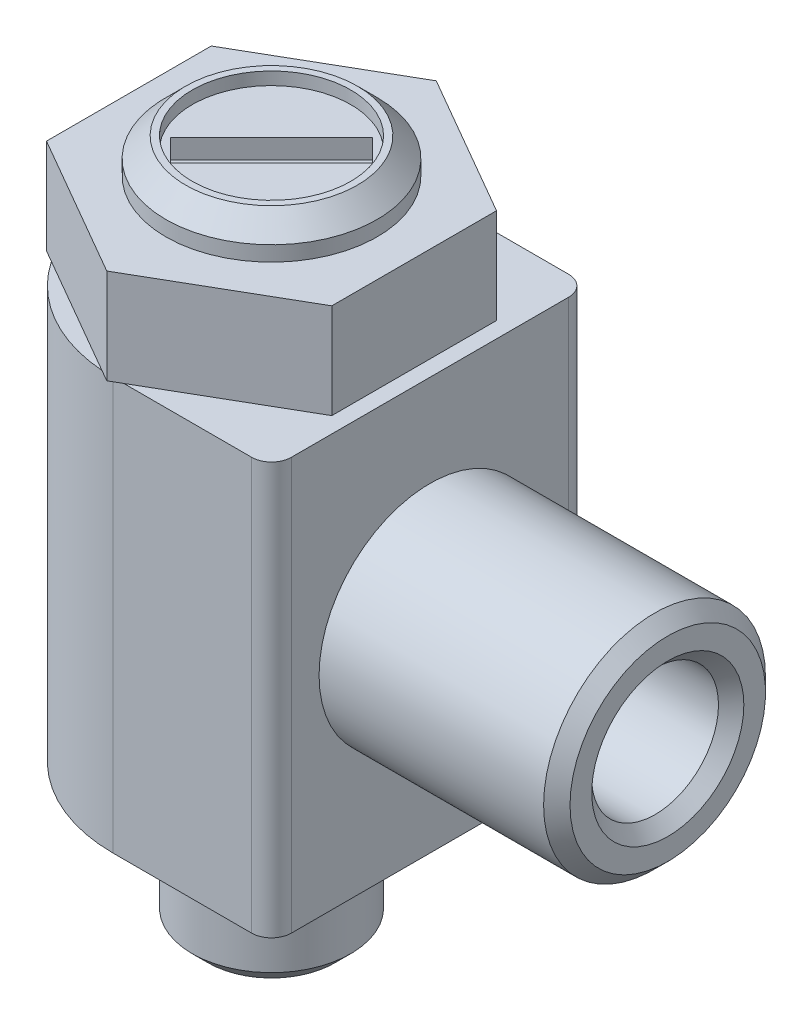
ISO-10303-21;
HEADER;
FILE_DESCRIPTION(('STEP AP214'),'2;1');
FILE_NAME('part.step','',(''),(''),'','','');
FILE_SCHEMA(('AUTOMOTIVE_DESIGN { 1 0 10303 214 1 1 1 1 }'));
ENDSEC;
DATA;
#1=APPLICATION_CONTEXT('core data for automotive mechanical design processes');
#2=APPLICATION_PROTOCOL_DEFINITION('international standard','automotive_design',2000,#1);
#3=PRODUCT_CONTEXT('',#1,'mechanical');
#4=PRODUCT('Part','Part','',(#3));
#5=PRODUCT_RELATED_PRODUCT_CATEGORY('part','',(#4));
#6=PRODUCT_DEFINITION_FORMATION('','',#4);
#7=PRODUCT_DEFINITION_CONTEXT('part definition',#1,'design');
#8=PRODUCT_DEFINITION('design','',#6,#7);
#9=PRODUCT_DEFINITION_SHAPE('','',#8);
#10=(LENGTH_UNIT() NAMED_UNIT(*) SI_UNIT(.MILLI.,.METRE.));
#11=(NAMED_UNIT(*) PLANE_ANGLE_UNIT() SI_UNIT($,.RADIAN.));
#12=(NAMED_UNIT(*) SI_UNIT($,.STERADIAN.) SOLID_ANGLE_UNIT());
#13=UNCERTAINTY_MEASURE_WITH_UNIT(LENGTH_MEASURE(1.E-05),#10,'distance_accuracy_value','');
#14=(GEOMETRIC_REPRESENTATION_CONTEXT(3) GLOBAL_UNCERTAINTY_ASSIGNED_CONTEXT((#13)) GLOBAL_UNIT_ASSIGNED_CONTEXT((#10,
#11,#12)) REPRESENTATION_CONTEXT('',''));
#15=CARTESIAN_POINT('',(0.,0.,0.));
#16=DIRECTION('',(0.,0.,1.));
#17=DIRECTION('',(1.,0.,0.));
#18=AXIS2_PLACEMENT_3D('',#15,#16,#17);
#19=CARTESIAN_POINT('',(0.,16.575,0.));
#20=DIRECTION('',(0.,1.,0.));
#21=DIRECTION('',(0.,0.,1.));
#22=AXIS2_PLACEMENT_3D('',#19,#20,#21);
#23=PLANE('',#22);
#24=DIRECTION('',(-0.707106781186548,0.,0.707106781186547));
#25=VECTOR('',#24,1.);
#26=CARTESIAN_POINT('',(1.23743686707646,16.5750000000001,-1.94454364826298));
#27=LINE('',#26,#25);
#28=CARTESIAN_POINT('',(1.23743686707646,16.5750000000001,-1.94454364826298));
#29=VERTEX_POINT('',#28);
#30=CARTESIAN_POINT('',(-1.94454364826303,16.575,1.23743686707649));
#31=VERTEX_POINT('',#30);
#32=EDGE_CURVE('E610',#29,#31,#27,.T.);
#33=ORIENTED_EDGE('',*,*,#32,.T.);
#34=DIRECTION('',(0.707106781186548,0.,0.707106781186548));
#35=VECTOR('',#34,1.);
#36=CARTESIAN_POINT('',(-1.94454364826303,16.575,1.23743686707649));
#37=LINE('',#36,#35);
#38=CARTESIAN_POINT('',(-1.23743686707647,16.5750000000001,1.94454364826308));
#39=VERTEX_POINT('',#38);
#40=EDGE_CURVE('E615',#31,#39,#37,.T.);
#41=ORIENTED_EDGE('',*,*,#40,.T.);
#42=DIRECTION('',(0.707106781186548,0.,-0.707106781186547));
#43=VECTOR('',#42,1.);
#44=CARTESIAN_POINT('',(-1.23743686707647,16.5750000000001,1.94454364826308));
#45=LINE('',#44,#43);
#46=CARTESIAN_POINT('',(1.94454364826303,16.575,-1.23743686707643));
#47=VERTEX_POINT('',#46);
#48=EDGE_CURVE('E620',#39,#47,#45,.T.);
#49=ORIENTED_EDGE('',*,*,#48,.T.);
#50=DIRECTION('',(-0.707106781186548,0.,-0.707106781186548));
#51=VECTOR('',#50,1.);
#52=CARTESIAN_POINT('',(1.94454364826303,16.575,-1.23743686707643));
#53=LINE('',#52,#51);
#54=EDGE_CURVE('E625',#47,#29,#53,.T.);
#55=ORIENTED_EDGE('',*,*,#54,.T.);
#56=EDGE_LOOP('',(#33,#41,#49,#55));
#57=FACE_BOUND('',#56,.T.);
#58=ADVANCED_FACE('F16',(#57),#23,.T.);
#59=CARTESIAN_POINT('',(-1.23743686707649,17.2000000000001,1.94454364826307));
#60=DIRECTION('',(0.707106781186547,0.,0.707106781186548));
#61=DIRECTION('',(0.707106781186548,0.,-0.707106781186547));
#62=AXIS2_PLACEMENT_3D('',#59,#60,#61);
#63=PLANE('',#62);
#64=DIRECTION('',(0.,1.,0.));
#65=VECTOR('',#64,1.);
#66=CARTESIAN_POINT('',(-1.23743686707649,17.2000000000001,1.94454364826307));
#67=LINE('',#66,#65);
#68=CARTESIAN_POINT('',(-1.23743686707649,17.2000000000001,1.94454364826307));
#69=VERTEX_POINT('',#68);
#70=EDGE_CURVE('E618',#39,#69,#67,.T.);
#71=ORIENTED_EDGE('',*,*,#70,.T.);
#72=DIRECTION('',(-0.707106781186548,0.,0.707106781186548));
#73=VECTOR('',#72,1.);
#74=CARTESIAN_POINT('',(1.94454364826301,17.2,-1.23743686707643));
#75=LINE('',#74,#73);
#76=CARTESIAN_POINT('',(1.94454364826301,17.2,-1.23743686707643));
#77=VERTEX_POINT('',#76);
#78=EDGE_CURVE('E596',#77,#69,#75,.T.);
#79=ORIENTED_EDGE('',*,*,#78,.F.);
#80=DIRECTION('',(0.,1.,0.));
#81=VECTOR('',#80,1.);
#82=CARTESIAN_POINT('',(1.94454364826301,17.2,-1.23743686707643));
#83=LINE('',#82,#81);
#84=EDGE_CURVE('E600',#77,#47,#83,.F.);
#85=ORIENTED_EDGE('',*,*,#84,.T.);
#86=ORIENTED_EDGE('',*,*,#48,.F.);
#87=EDGE_LOOP('',(#71,#79,#85,#86));
#88=FACE_BOUND('',#87,.T.);
#89=ADVANCED_FACE('F647',(#88),#63,.F.);
#90=CARTESIAN_POINT('',(-1.94454364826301,17.2,1.23743686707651));
#91=DIRECTION('',(-0.707106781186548,0.,0.707106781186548));
#92=DIRECTION('',(0.707106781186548,0.,0.707106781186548));
#93=AXIS2_PLACEMENT_3D('',#90,#91,#92);
#94=PLANE('',#93);
#95=DIRECTION('',(0.,1.,0.));
#96=VECTOR('',#95,1.);
#97=CARTESIAN_POINT('',(-1.94454364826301,17.2,1.23743686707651));
#98=LINE('',#97,#96);
#99=CARTESIAN_POINT('',(-1.94454364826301,17.2,1.23743686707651));
#100=VERTEX_POINT('',#99);
#101=EDGE_CURVE('E613',#31,#100,#98,.T.);
#102=ORIENTED_EDGE('',*,*,#101,.T.);
#103=DIRECTION('',(-0.707106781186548,0.,-0.707106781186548));
#104=VECTOR('',#103,1.);
#105=CARTESIAN_POINT('',(-1.23743686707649,17.2000000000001,1.94454364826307));
#106=LINE('',#105,#104);
#107=EDGE_CURVE('E599',#69,#100,#106,.T.);
#108=ORIENTED_EDGE('',*,*,#107,.F.);
#109=ORIENTED_EDGE('',*,*,#70,.F.);
#110=ORIENTED_EDGE('',*,*,#40,.F.);
#111=EDGE_LOOP('',(#102,#108,#109,#110));
#112=FACE_BOUND('',#111,.T.);
#113=ADVANCED_FACE('F641',(#112),#94,.F.);
#114=CARTESIAN_POINT('',(1.23743686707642,17.2000000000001,-1.94454364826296));
#115=DIRECTION('',(-0.707106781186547,0.,-0.707106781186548));
#116=DIRECTION('',(-0.707106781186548,0.,0.707106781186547));
#117=AXIS2_PLACEMENT_3D('',#114,#115,#116);
#118=PLANE('',#117);
#119=DIRECTION('',(0.,1.,0.));
#120=VECTOR('',#119,1.);
#121=CARTESIAN_POINT('',(1.23743686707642,17.2000000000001,-1.94454364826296));
#122=LINE('',#121,#120);
#123=CARTESIAN_POINT('',(1.23743686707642,17.2000000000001,-1.94454364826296));
#124=VERTEX_POINT('',#123);
#125=EDGE_CURVE('E121',#29,#124,#122,.T.);
#126=ORIENTED_EDGE('',*,*,#125,.T.);
#127=DIRECTION('',(0.707106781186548,0.,-0.707106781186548));
#128=VECTOR('',#127,1.);
#129=CARTESIAN_POINT('',(-1.94454364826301,17.2,1.23743686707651));
#130=LINE('',#129,#128);
#131=EDGE_CURVE('E603',#100,#124,#130,.T.);
#132=ORIENTED_EDGE('',*,*,#131,.F.);
#133=ORIENTED_EDGE('',*,*,#101,.F.);
#134=ORIENTED_EDGE('',*,*,#32,.F.);
#135=EDGE_LOOP('',(#126,#132,#133,#134));
#136=FACE_BOUND('',#135,.T.);
#137=ADVANCED_FACE('F634',(#136),#118,.F.);
#138=CARTESIAN_POINT('',(1.94454364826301,17.2,-1.23743686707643));
#139=DIRECTION('',(0.707106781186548,0.,-0.707106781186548));
#140=DIRECTION('',(-0.707106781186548,0.,-0.707106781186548));
#141=AXIS2_PLACEMENT_3D('',#138,#139,#140);
#142=PLANE('',#141);
#143=ORIENTED_EDGE('',*,*,#84,.F.);
#144=DIRECTION('',(0.707106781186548,0.,0.707106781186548));
#145=VECTOR('',#144,1.);
#146=CARTESIAN_POINT('',(1.23743686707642,17.2000000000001,-1.94454364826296));
#147=LINE('',#146,#145);
#148=EDGE_CURVE('E606',#124,#77,#147,.T.);
#149=ORIENTED_EDGE('',*,*,#148,.F.);
#150=ORIENTED_EDGE('',*,*,#125,.F.);
#151=ORIENTED_EDGE('',*,*,#54,.F.);
#152=EDGE_LOOP('',(#143,#149,#150,#151));
#153=FACE_BOUND('',#152,.T.);
#154=ADVANCED_FACE('F635',(#153),#142,.F.);
#155=CARTESIAN_POINT('',(1.24999999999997,17.2,0.));
#156=DIRECTION('',(0.,1.,0.));
#157=DIRECTION('',(0.,0.,1.));
#158=AXIS2_PLACEMENT_3D('',#155,#156,#157);
#159=PLANE('',#158);
#160=CARTESIAN_POINT('',(0.,17.2,0.));
#161=DIRECTION('',(0.,1.,0.));
#162=DIRECTION('',(0.,0.,1.));
#163=AXIS2_PLACEMENT_3D('',#160,#161,#162);
#164=CIRCLE('',#163,2.5);
#165=CARTESIAN_POINT('',(0.,17.2,2.50000000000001));
#166=VERTEX_POINT('',#165);
#167=EDGE_CURVE('E20',#166,#166,#164,.T.);
#168=ORIENTED_EDGE('',*,*,#167,.T.);
#169=EDGE_LOOP('',(#168));
#170=FACE_BOUND('',#169,.T.);
#171=ORIENTED_EDGE('',*,*,#131,.T.);
#172=ORIENTED_EDGE('',*,*,#148,.T.);
#173=ORIENTED_EDGE('',*,*,#78,.T.);
#174=ORIENTED_EDGE('',*,*,#107,.T.);
#175=EDGE_LOOP('',(#171,#172,#173,#174));
#176=FACE_BOUND('',#175,.T.);
#177=ADVANCED_FACE('F637',(#170,#176),#159,.T.);
#178=CARTESIAN_POINT('',(0.,8.1,0.));
#179=DIRECTION('',(-1.,0.,0.));
#180=DIRECTION('',(0.,0.,1.));
#181=AXIS2_PLACEMENT_3D('',#178,#179,#180);
#182=PLANE('',#181);
#183=CARTESIAN_POINT('',(0.,7.1,0.));
#184=DIRECTION('',(-1.,0.,0.));
#185=DIRECTION('',(0.,0.,1.));
#186=AXIS2_PLACEMENT_3D('',#183,#184,#185);
#187=CIRCLE('',#186,2.);
#188=CARTESIAN_POINT('',(0.,8.6612494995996,1.25000000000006));
#189=VERTEX_POINT('',#188);
#190=CARTESIAN_POINT('',(0.,5.5387505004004,1.25000000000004));
#191=VERTEX_POINT('',#190);
#192=EDGE_CURVE('E686',#189,#191,#187,.F.);
#193=ORIENTED_EDGE('',*,*,#192,.T.);
#194=DIRECTION('',(0.,1.,0.));
#195=VECTOR('',#194,1.);
#196=CARTESIAN_POINT('',(0.,4.9,1.25000000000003));
#197=LINE('',#196,#195);
#198=EDGE_CURVE('E593',#191,#189,#197,.T.);
#199=ORIENTED_EDGE('',*,*,#198,.T.);
#200=EDGE_LOOP('',(#193,#199));
#201=FACE_BOUND('',#200,.T.);
#202=ADVANCED_FACE('F663',(#201),#182,.F.);
#203=CARTESIAN_POINT('',(0.,8.1,0.));
#204=DIRECTION('',(-1.,0.,0.));
#205=DIRECTION('',(0.,0.,1.));
#206=AXIS2_PLACEMENT_3D('',#203,#204,#205);
#207=PLANE('',#206);
#208=CARTESIAN_POINT('',(0.,7.1,0.));
#209=DIRECTION('',(-1.,0.,0.));
#210=DIRECTION('',(0.,0.,1.));
#211=AXIS2_PLACEMENT_3D('',#208,#209,#210);
#212=CIRCLE('',#211,2.);
#213=CARTESIAN_POINT('',(0.,5.5387505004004,-1.24999999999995));
#214=VERTEX_POINT('',#213);
#215=CARTESIAN_POINT('',(0.,8.6612494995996,-1.24999999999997));
#216=VERTEX_POINT('',#215);
#217=EDGE_CURVE('E595',#214,#216,#212,.F.);
#218=ORIENTED_EDGE('',*,*,#217,.T.);
#219=DIRECTION('',(0.,1.,0.));
#220=VECTOR('',#219,1.);
#221=CARTESIAN_POINT('',(0.,4.9,-1.24999999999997));
#222=LINE('',#221,#220);
#223=EDGE_CURVE('E328',#216,#214,#222,.F.);
#224=ORIENTED_EDGE('',*,*,#223,.T.);
#225=EDGE_LOOP('',(#218,#224));
#226=FACE_BOUND('',#225,.T.);
#227=ADVANCED_FACE('F667',(#226),#207,.F.);
#228=CARTESIAN_POINT('',(0.624999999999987,13.9,0.));
#229=DIRECTION('',(0.,1.,0.));
#230=DIRECTION('',(0.,0.,1.));
#231=AXIS2_PLACEMENT_3D('',#228,#229,#230);
#232=PLANE('',#231);
#233=CARTESIAN_POINT('',(0.,13.9,0.));
#234=DIRECTION('',(0.,1.,0.));
#235=DIRECTION('',(0.,0.,1.));
#236=AXIS2_PLACEMENT_3D('',#233,#234,#235);
#237=CIRCLE('',#236,1.25);
#238=CARTESIAN_POINT('',(0.,13.9,1.25000000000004));
#239=VERTEX_POINT('',#238);
#240=EDGE_CURVE('E319',#239,#239,#237,.F.);
#241=ORIENTED_EDGE('',*,*,#240,.T.);
#242=EDGE_LOOP('',(#241));
#243=FACE_BOUND('',#242,.T.);
#244=ADVANCED_FACE('F671',(#243),#232,.F.);
#245=CARTESIAN_POINT('',(0.,17.4,0.));
#246=DIRECTION('',(0.,1.,0.));
#247=DIRECTION('',(0.,0.,1.));
#248=AXIS2_PLACEMENT_3D('',#245,#246,#247);
#249=CYLINDRICAL_SURFACE('',#248,2.5);
#250=ORIENTED_EDGE('',*,*,#167,.F.);
#251=EDGE_LOOP('',(#250));
#252=FACE_BOUND('',#251,.T.);
#253=CARTESIAN_POINT('',(0.,17.6,0.));
#254=DIRECTION('',(0.,1.,0.));
#255=DIRECTION('',(0.,0.,1.));
#256=AXIS2_PLACEMENT_3D('',#253,#254,#255);
#257=CIRCLE('',#256,2.5);
#258=CARTESIAN_POINT('',(0.,17.6,2.50000000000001));
#259=VERTEX_POINT('',#258);
#260=EDGE_CURVE('E248',#259,#259,#257,.F.);
#261=ORIENTED_EDGE('',*,*,#260,.F.);
#262=EDGE_LOOP('',(#261));
#263=FACE_BOUND('',#262,.T.);
#264=ADVANCED_FACE('F674',(#252,#263),#249,.F.);
#265=CARTESIAN_POINT('',(6.05,7.10000000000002,0.));
#266=DIRECTION('',(-1.,0.,0.));
#267=DIRECTION('',(0.,0.,1.));
#268=AXIS2_PLACEMENT_3D('',#265,#266,#267);
#269=CYLINDRICAL_SURFACE('',#268,2.);
#270=CARTESIAN_POINT('',(0.,5.5387505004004,-1.24999999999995));
#271=CARTESIAN_POINT('',(0.0313026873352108,5.53876117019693,-1.2500041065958));
#272=CARTESIAN_POINT('',(0.0625845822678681,5.53780799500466,-1.24882344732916));
#273=CARTESIAN_POINT('',(0.124830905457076,5.5340736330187,-1.24414174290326));
#274=CARTESIAN_POINT('',(0.155795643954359,5.53129444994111,-1.24064324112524));
#275=CARTESIAN_POINT('',(0.247320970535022,5.52043301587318,-1.22682862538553));
#276=CARTESIAN_POINT('',(0.307115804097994,5.50982303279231,-1.21319125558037));
#277=CARTESIAN_POINT('',(0.422726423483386,5.4835167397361,-1.17790269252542));
#278=CARTESIAN_POINT('',(0.47855698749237,5.46784067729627,-1.15628335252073));
#279=CARTESIAN_POINT('',(0.585877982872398,5.43321679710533,-1.10579052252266));
#280=CARTESIAN_POINT('',(0.63735726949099,5.41426093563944,-1.07689911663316));
#281=CARTESIAN_POINT('',(0.741878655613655,5.3721991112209,-1.00823145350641));
#282=CARTESIAN_POINT('',(0.794217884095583,5.34887650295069,-0.967518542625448));
#283=CARTESIAN_POINT('',(0.89190206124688,5.30246171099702,-0.878287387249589));
#284=CARTESIAN_POINT('',(0.937243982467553,5.27936963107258,-0.829765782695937));
#285=CARTESIAN_POINT('',(1.02511066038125,5.23270174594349,-0.719178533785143));
#286=CARTESIAN_POINT('',(1.06662993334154,5.20940578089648,-0.656184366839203));
#287=CARTESIAN_POINT('',(1.13813483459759,5.16816205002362,-0.522379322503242));
#288=CARTESIAN_POINT('',(1.16813536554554,5.15020738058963,-0.451578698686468));
#289=CARTESIAN_POINT('',(1.21064440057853,5.12441614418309,-0.317576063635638));
#290=CARTESIAN_POINT('',(1.2253304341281,5.11533951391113,-0.25530287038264));
#291=CARTESIAN_POINT('',(1.24500431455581,5.1031339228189,-0.128684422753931));
#292=CARTESIAN_POINT('',(1.24999928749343,5.1000005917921,-0.064340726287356));
#293=CARTESIAN_POINT('',(1.25000070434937,5.09999941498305,0.0636041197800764));
#294=CARTESIAN_POINT('',(1.24512084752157,5.10306024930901,0.127205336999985));
#295=CARTESIAN_POINT('',(1.22589107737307,5.11499299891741,0.252399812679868));
#296=CARTESIAN_POINT('',(1.21153746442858,5.1238671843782,0.313992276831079));
#297=CARTESIAN_POINT('',(1.17419114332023,5.14653983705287,0.433201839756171));
#298=CARTESIAN_POINT('',(1.1512355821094,5.1603171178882,0.490834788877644));
#299=CARTESIAN_POINT('',(1.09762115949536,5.19165005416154,0.601247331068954));
#300=CARTESIAN_POINT('',(1.06696137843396,5.20920616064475,0.654026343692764));
#301=CARTESIAN_POINT('',(0.99611922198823,5.24829518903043,0.757965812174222));
#302=CARTESIAN_POINT('',(0.95537328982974,5.27003338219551,0.808663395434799));
#303=CARTESIAN_POINT('',(0.866796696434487,5.31467915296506,0.90297224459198));
#304=CARTESIAN_POINT('',(0.818954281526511,5.33758862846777,0.946571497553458));
#305=CARTESIAN_POINT('',(0.709906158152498,5.38572132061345,1.03147397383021));
#306=CARTESIAN_POINT('',(0.64776780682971,5.41083395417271,1.07165304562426));
#307=CARTESIAN_POINT('',(0.516304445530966,5.45673989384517,1.14079716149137));
#308=CARTESIAN_POINT('',(0.447006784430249,5.47754878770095,1.16980301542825));
#309=CARTESIAN_POINT('',(0.315424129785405,5.50824338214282,1.21113990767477));
#310=CARTESIAN_POINT('',(0.254105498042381,5.51941784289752,1.22552680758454));
#311=CARTESIAN_POINT('',(0.160139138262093,5.53087292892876,1.24011165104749));
#312=CARTESIAN_POINT('',(0.128325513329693,5.53380797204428,1.24380797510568));
#313=CARTESIAN_POINT('',(0.0643486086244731,5.53775419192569,1.24875630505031));
#314=CARTESIAN_POINT('',(0.0321849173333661,5.5387627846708,1.25000502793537));
#315=CARTESIAN_POINT('',(0.,5.5387505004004,1.25000000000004));
#316=B_SPLINE_CURVE_WITH_KNOTS('',3,(#270,#271,#272,#273,#274,#275,#276,#277,#278,#279,#280,
#281,#282,#283,#284,#285,#286,#287,#288,#289,#290,#291,#292,#293,#294,#295,#296,#297,#298,#299,
#300,#301,#302,#303,#304,#305,#306,#307,#308,#309,#310,#311,#312,#313,#314,#315),.UNSPECIFIED.,
.F.,.F.,(4,2,2,2,2,2,2,2,2,2,2,2,2,2,2,2,2,2,2,2,2,2,4),(0.,0.0938329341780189,
0.187563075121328,0.3732425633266,0.558188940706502,0.743595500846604,0.953662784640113,
1.16382070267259,1.39941924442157,1.63471193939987,1.82761740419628,2.02038096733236,
2.21093767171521,2.40156883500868,2.59138608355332,2.78122600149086,2.98616996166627,
3.19145723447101,3.42474295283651,3.65716833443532,3.84797308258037,3.94431993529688,
4.04079593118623),.UNSPECIFIED.);
#317=EDGE_CURVE('E112',#214,#191,#316,.T.);
#318=ORIENTED_EDGE('',*,*,#317,.T.);
#319=ORIENTED_EDGE('',*,*,#192,.F.);
#320=CARTESIAN_POINT('',(0.,8.6612494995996,1.25000000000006));
#321=CARTESIAN_POINT('',(0.0313026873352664,8.66123882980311,1.25000410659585));
#322=CARTESIAN_POINT('',(0.062584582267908,8.6621920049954,1.24882344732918));
#323=CARTESIAN_POINT('',(0.124830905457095,8.66592636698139,1.24414174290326));
#324=CARTESIAN_POINT('',(0.155795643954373,8.66870555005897,1.24064324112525));
#325=CARTESIAN_POINT('',(0.247320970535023,8.67956698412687,1.22682862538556));
#326=CARTESIAN_POINT('',(0.307115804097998,8.69017696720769,1.21319125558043));
#327=CARTESIAN_POINT('',(0.422726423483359,8.71648326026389,1.17790269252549));
#328=CARTESIAN_POINT('',(0.478556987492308,8.73215932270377,1.15628335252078));
#329=CARTESIAN_POINT('',(0.585877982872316,8.76678320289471,1.10579052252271));
#330=CARTESIAN_POINT('',(0.637357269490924,8.78573906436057,1.07689911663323));
#331=CARTESIAN_POINT('',(0.741878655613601,8.82780088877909,1.0082314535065));
#332=CARTESIAN_POINT('',(0.794217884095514,8.85112349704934,0.967518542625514));
#333=CARTESIAN_POINT('',(0.891902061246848,8.89753828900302,0.878287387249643));
#334=CARTESIAN_POINT('',(0.937243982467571,8.92063036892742,0.829765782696));
#335=CARTESIAN_POINT('',(1.02511066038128,8.9672982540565,0.719178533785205));
#336=CARTESIAN_POINT('',(1.06662993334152,8.99059421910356,0.656184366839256));
#337=CARTESIAN_POINT('',(1.13813483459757,9.03183794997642,0.522379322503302));
#338=CARTESIAN_POINT('',(1.16813536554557,9.04979261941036,0.451578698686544));
#339=CARTESIAN_POINT('',(1.21064440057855,9.0755838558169,0.317576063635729));
#340=CARTESIAN_POINT('',(1.22533043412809,9.0846604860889,0.255302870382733));
#341=CARTESIAN_POINT('',(1.24500431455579,9.09686607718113,0.128684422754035));
#342=CARTESIAN_POINT('',(1.24999928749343,9.0999994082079,0.0643407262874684));
#343=CARTESIAN_POINT('',(1.25000070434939,9.10000058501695,-0.0636041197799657));
#344=CARTESIAN_POINT('',(1.24512084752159,9.09693975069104,-0.127205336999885));
#345=CARTESIAN_POINT('',(1.22589107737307,9.08500700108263,-0.252399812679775));
#346=CARTESIAN_POINT('',(1.21153746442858,9.07613281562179,-0.313992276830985));
#347=CARTESIAN_POINT('',(1.17419114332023,9.05346016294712,-0.43320183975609));
#348=CARTESIAN_POINT('',(1.15123558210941,9.03968288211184,-0.490834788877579));
#349=CARTESIAN_POINT('',(1.09762115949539,9.00834994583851,-0.601247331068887));
#350=CARTESIAN_POINT('',(1.06696137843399,8.99079383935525,-0.654026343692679));
#351=CARTESIAN_POINT('',(0.996119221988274,8.95170481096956,-0.757965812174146));
#352=CARTESIAN_POINT('',(0.95537328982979,8.92996661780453,-0.808663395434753));
#353=CARTESIAN_POINT('',(0.866796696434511,8.88532084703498,-0.902972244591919));
#354=CARTESIAN_POINT('',(0.818954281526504,8.86241137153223,-0.94657149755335));
#355=CARTESIAN_POINT('',(0.70990615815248,8.81427867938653,-1.03147397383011));
#356=CARTESIAN_POINT('',(0.647767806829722,8.78916604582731,-1.07165304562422));
#357=CARTESIAN_POINT('',(0.516304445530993,8.74326010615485,-1.14079716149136));
#358=CARTESIAN_POINT('',(0.447006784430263,8.72245121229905,-1.16980301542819));
#359=CARTESIAN_POINT('',(0.315424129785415,8.69175661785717,-1.21113990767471));
#360=CARTESIAN_POINT('',(0.254105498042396,8.68058215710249,-1.22552680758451));
#361=CARTESIAN_POINT('',(0.160139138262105,8.66912707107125,-1.24011165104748));
#362=CARTESIAN_POINT('',(0.128325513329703,8.66619202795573,-1.24380797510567));
#363=CARTESIAN_POINT('',(0.0643486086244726,8.66224580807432,-1.24875630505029));
#364=CARTESIAN_POINT('',(0.0321849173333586,8.6612372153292,-1.25000502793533));
#365=CARTESIAN_POINT('',(0.,8.6612494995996,-1.24999999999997));
#366=B_SPLINE_CURVE_WITH_KNOTS('',3,(#320,#321,#322,#323,#324,#325,#326,#327,#328,#329,#330,
#331,#332,#333,#334,#335,#336,#337,#338,#339,#340,#341,#342,#343,#344,#345,#346,#347,#348,#349,
#350,#351,#352,#353,#354,#355,#356,#357,#358,#359,#360,#361,#362,#363,#364,#365),.UNSPECIFIED.,
.F.,.F.,(4,2,2,2,2,2,2,2,2,2,2,2,2,2,2,2,2,2,2,2,2,2,4),(0.,0.0938329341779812,
0.187563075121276,0.373242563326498,0.558188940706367,0.74359550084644,0.953662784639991,
1.16382070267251,1.39941924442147,1.63471193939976,1.82761740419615,2.02038096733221,
2.21093767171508,2.40156883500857,2.59138608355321,2.78122600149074,2.98616996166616,
3.19145723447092,3.42474295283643,3.65716833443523,3.84797308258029,3.94431993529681,
4.04079593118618),.UNSPECIFIED.);
#367=EDGE_CURVE('E104',#189,#216,#366,.T.);
#368=ORIENTED_EDGE('',*,*,#367,.T.);
#369=ORIENTED_EDGE('',*,*,#217,.F.);
#370=EDGE_LOOP('',(#318,#319,#368,#369));
#371=FACE_BOUND('',#370,.T.);
#372=CARTESIAN_POINT('',(12.1000000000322,7.10000000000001,0.));
#373=DIRECTION('',(1.,0.,0.));
#374=DIRECTION('',(0.,1.,0.));
#375=AXIS2_PLACEMENT_3D('',#372,#373,#374);
#376=CIRCLE('',#375,2.00000000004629);
#377=CARTESIAN_POINT('',(12.1000000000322,9.10000000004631,0.));
#378=VERTEX_POINT('',#377);
#379=EDGE_CURVE('E244',#378,#378,#376,.T.);
#380=ORIENTED_EDGE('',*,*,#379,.T.);
#381=EDGE_LOOP('',(#380));
#382=FACE_BOUND('',#381,.T.);
#383=ADVANCED_FACE('F333',(#371,#382),#269,.F.);
#384=CARTESIAN_POINT('',(0.,4.9,0.));
#385=DIRECTION('',(0.,1.,0.));
#386=DIRECTION('',(0.,0.,1.));
#387=AXIS2_PLACEMENT_3D('',#384,#385,#386);
#388=CYLINDRICAL_SURFACE('',#387,1.25);
#389=CARTESIAN_POINT('',(0.,-4.,0.));
#390=DIRECTION('',(0.,1.,0.));
#391=DIRECTION('',(0.,0.,1.));
#392=AXIS2_PLACEMENT_3D('',#389,#390,#391);
#393=CIRCLE('',#392,1.25);
#394=CARTESIAN_POINT('',(0.,-4.,1.25000000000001));
#395=VERTEX_POINT('',#394);
#396=EDGE_CURVE('E247',#395,#395,#393,.T.);
#397=ORIENTED_EDGE('',*,*,#396,.F.);
#398=EDGE_LOOP('',(#397));
#399=FACE_BOUND('',#398,.T.);
#400=ORIENTED_EDGE('',*,*,#240,.F.);
#401=EDGE_LOOP('',(#400));
#402=FACE_BOUND('',#401,.T.);
#403=ORIENTED_EDGE('',*,*,#198,.F.);
#404=ORIENTED_EDGE('',*,*,#317,.F.);
#405=ORIENTED_EDGE('',*,*,#223,.F.);
#406=ORIENTED_EDGE('',*,*,#367,.F.);
#407=EDGE_LOOP('',(#403,#404,#405,#406));
#408=FACE_BOUND('',#407,.T.);
#409=ADVANCED_FACE('F336',(#399,#402,#408),#388,.F.);
#410=CARTESIAN_POINT('',(2.60416666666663,17.6,0.));
#411=DIRECTION('',(0.,1.,0.));
#412=DIRECTION('',(0.,0.,1.));
#413=AXIS2_PLACEMENT_3D('',#410,#411,#412);
#414=PLANE('',#413);
#415=CARTESIAN_POINT('',(0.,17.6000000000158,0.));
#416=DIRECTION('',(0.,-1.,0.));
#417=DIRECTION('',(0.,0.,-1.));
#418=AXIS2_PLACEMENT_3D('',#415,#416,#417);
#419=CIRCLE('',#418,2.70833333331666);
#420=CARTESIAN_POINT('',(0.,17.6000000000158,-2.70833333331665));
#421=VERTEX_POINT('',#420);
#422=EDGE_CURVE('E312',#421,#421,#419,.T.);
#423=ORIENTED_EDGE('',*,*,#422,.F.);
#424=EDGE_LOOP('',(#423));
#425=FACE_BOUND('',#424,.T.);
#426=ORIENTED_EDGE('',*,*,#260,.T.);
#427=EDGE_LOOP('',(#426));
#428=FACE_BOUND('',#427,.T.);
#429=ADVANCED_FACE('F340',(#425,#428),#414,.T.);
#430=CARTESIAN_POINT('',(12.4999999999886,7.10000000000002,0.));
#431=DIRECTION('',(1.,0.,0.));
#432=DIRECTION('',(0.,0.,-1.));
#433=AXIS2_PLACEMENT_3D('',#430,#431,#432);
#434=CONICAL_SURFACE('',#433,2.40000000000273,0.785398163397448);
#435=ORIENTED_EDGE('',*,*,#379,.F.);
#436=EDGE_LOOP('',(#435));
#437=FACE_BOUND('',#436,.T.);
#438=CARTESIAN_POINT('',(12.4999999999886,7.10000000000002,0.));
#439=DIRECTION('',(1.,0.,0.));
#440=DIRECTION('',(0.,0.,-1.));
#441=AXIS2_PLACEMENT_3D('',#438,#439,#440);
#442=CIRCLE('',#441,2.40000000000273);
#443=CARTESIAN_POINT('',(12.4999999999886,7.10000000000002,-2.4000000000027));
#444=VERTEX_POINT('',#443);
#445=EDGE_CURVE('E309',#444,#444,#442,.F.);
#446=ORIENTED_EDGE('',*,*,#445,.F.);
#447=EDGE_LOOP('',(#446));
#448=FACE_BOUND('',#447,.T.);
#449=ADVANCED_FACE('F345',(#437,#448),#434,.F.);
#450=CARTESIAN_POINT('',(1.,-4.,0.));
#451=DIRECTION('',(0.,-1.,0.));
#452=DIRECTION('',(0.,0.,-1.));
#453=AXIS2_PLACEMENT_3D('',#450,#451,#452);
#454=PLANE('',#453);
#455=CARTESIAN_POINT('',(0.,-3.99999999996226,0.));
#456=DIRECTION('',(0.,1.,0.));
#457=DIRECTION('',(0.,0.,1.));
#458=AXIS2_PLACEMENT_3D('',#455,#456,#457);
#459=CIRCLE('',#458,2.00000000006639);
#460=CARTESIAN_POINT('',(0.,-3.99999999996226,2.00000000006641));
#461=VERTEX_POINT('',#460);
#462=EDGE_CURVE('E243',#461,#461,#459,.T.);
#463=ORIENTED_EDGE('',*,*,#462,.F.);
#464=EDGE_LOOP('',(#463));
#465=FACE_BOUND('',#464,.T.);
#466=ORIENTED_EDGE('',*,*,#396,.T.);
#467=EDGE_LOOP('',(#466));
#468=FACE_BOUND('',#467,.T.);
#469=ADVANCED_FACE('F349',(#465,#468),#454,.T.);
#470=CARTESIAN_POINT('',(0.,16.9750000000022,0.));
#471=DIRECTION('',(0.,-1.,0.));
#472=DIRECTION('',(0.,0.,-1.));
#473=AXIS2_PLACEMENT_3D('',#470,#471,#472);
#474=CONICAL_SURFACE('',#473,3.3333333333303,0.785398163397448);
#475=ORIENTED_EDGE('',*,*,#422,.T.);
#476=EDGE_LOOP('',(#475));
#477=FACE_BOUND('',#476,.T.);
#478=CARTESIAN_POINT('',(0.,16.975,0.));
#479=DIRECTION('',(0.,1.,0.));
#480=DIRECTION('',(0.,0.,1.));
#481=AXIS2_PLACEMENT_3D('',#478,#479,#480);
#482=CIRCLE('',#481,3.33333333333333);
#483=CARTESIAN_POINT('',(0.,16.975,3.33333333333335));
#484=VERTEX_POINT('',#483);
#485=EDGE_CURVE('E240',#484,#484,#482,.F.);
#486=ORIENTED_EDGE('',*,*,#485,.F.);
#487=EDGE_LOOP('',(#486));
#488=FACE_BOUND('',#487,.T.);
#489=ADVANCED_FACE('F353',(#477,#488),#474,.T.);
#490=CARTESIAN_POINT('',(12.5,8.64166666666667,0.));
#491=DIRECTION('',(1.,0.,0.));
#492=DIRECTION('',(0.,0.,-1.));
#493=AXIS2_PLACEMENT_3D('',#490,#491,#492);
#494=PLANE('',#493);
#495=CARTESIAN_POINT('',(12.5000000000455,7.10000000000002,0.));
#496=DIRECTION('',(-1.,0.,0.));
#497=DIRECTION('',(0.,0.,1.));
#498=AXIS2_PLACEMENT_3D('',#495,#496,#497);
#499=CIRCLE('',#498,3.08333333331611);
#500=CARTESIAN_POINT('',(12.5000000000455,7.10000000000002,3.08333333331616));
#501=VERTEX_POINT('',#500);
#502=EDGE_CURVE('E239',#501,#501,#499,.T.);
#503=ORIENTED_EDGE('',*,*,#502,.F.);
#504=EDGE_LOOP('',(#503));
#505=FACE_BOUND('',#504,.T.);
#506=ORIENTED_EDGE('',*,*,#445,.T.);
#507=EDGE_LOOP('',(#506));
#508=FACE_BOUND('',#507,.T.);
#509=ADVANCED_FACE('F357',(#505,#508),#494,.T.);
#510=CARTESIAN_POINT('',(0.,-3.49999999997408,0.));
#511=DIRECTION('',(0.,1.,0.));
#512=DIRECTION('',(0.,0.,1.));
#513=AXIS2_PLACEMENT_3D('',#510,#511,#512);
#514=CONICAL_SURFACE('',#513,2.50000000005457,0.785398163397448);
#515=CARTESIAN_POINT('',(0.,-3.5,0.));
#516=DIRECTION('',(0.,1.,0.));
#517=DIRECTION('',(0.,0.,1.));
#518=AXIS2_PLACEMENT_3D('',#515,#516,#517);
#519=CIRCLE('',#518,2.5);
#520=CARTESIAN_POINT('',(0.,-3.5,2.50000000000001));
#521=VERTEX_POINT('',#520);
#522=EDGE_CURVE('E236',#521,#521,#519,.T.);
#523=ORIENTED_EDGE('',*,*,#522,.F.);
#524=EDGE_LOOP('',(#523));
#525=FACE_BOUND('',#524,.T.);
#526=ORIENTED_EDGE('',*,*,#462,.T.);
#527=EDGE_LOOP('',(#526));
#528=FACE_BOUND('',#527,.T.);
#529=ADVANCED_FACE('F361',(#525,#528),#514,.T.);
#530=CARTESIAN_POINT('',(0.,15.7875,0.));
#531=DIRECTION('',(0.,1.,0.));
#532=DIRECTION('',(0.,0.,1.));
#533=AXIS2_PLACEMENT_3D('',#530,#531,#532);
#534=CYLINDRICAL_SURFACE('',#533,3.33333333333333);
#535=ORIENTED_EDGE('',*,*,#485,.T.);
#536=EDGE_LOOP('',(#535));
#537=FACE_BOUND('',#536,.T.);
#538=CARTESIAN_POINT('',(0.,16.5,0.));
#539=DIRECTION('',(0.,1.,0.));
#540=DIRECTION('',(0.,0.,1.));
#541=AXIS2_PLACEMENT_3D('',#538,#539,#540);
#542=CIRCLE('',#541,3.33333333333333);
#543=CARTESIAN_POINT('',(0.,16.5,3.33333333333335));
#544=VERTEX_POINT('',#543);
#545=EDGE_CURVE('E235',#544,#544,#542,.F.);
#546=ORIENTED_EDGE('',*,*,#545,.F.);
#547=EDGE_LOOP('',(#546));
#548=FACE_BOUND('',#547,.T.);
#549=ADVANCED_FACE('F365',(#537,#548),#534,.T.);
#550=CARTESIAN_POINT('',(12.0833333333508,7.10000000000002,0.));
#551=DIRECTION('',(-1.,0.,0.));
#552=DIRECTION('',(0.,0.,1.));
#553=AXIS2_PLACEMENT_3D('',#550,#551,#552);
#554=CONICAL_SURFACE('',#553,3.49999999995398,0.785398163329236);
#555=ORIENTED_EDGE('',*,*,#502,.T.);
#556=EDGE_LOOP('',(#555));
#557=FACE_BOUND('',#556,.T.);
#558=CARTESIAN_POINT('',(12.0833333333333,7.10000000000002,0.));
#559=DIRECTION('',(-1.,0.,0.));
#560=DIRECTION('',(0.,0.,1.));
#561=AXIS2_PLACEMENT_3D('',#558,#559,#560);
#562=CIRCLE('',#561,3.5);
#563=CARTESIAN_POINT('',(12.0833333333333,7.10000000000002,3.50000000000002));
#564=VERTEX_POINT('',#563);
#565=EDGE_CURVE('E232',#564,#564,#562,.T.);
#566=ORIENTED_EDGE('',*,*,#565,.F.);
#567=EDGE_LOOP('',(#566));
#568=FACE_BOUND('',#567,.T.);
#569=ADVANCED_FACE('F369',(#557,#568),#554,.T.);
#570=CARTESIAN_POINT('',(0.,-1.75,0.));
#571=DIRECTION('',(0.,1.,0.));
#572=DIRECTION('',(0.,0.,1.));
#573=AXIS2_PLACEMENT_3D('',#570,#571,#572);
#574=CYLINDRICAL_SURFACE('',#573,2.5);
#575=CARTESIAN_POINT('',(0.,0.,0.));
#576=DIRECTION('',(0.,1.,0.));
#577=DIRECTION('',(0.,0.,1.));
#578=AXIS2_PLACEMENT_3D('',#575,#576,#577);
#579=CIRCLE('',#578,2.5);
#580=CARTESIAN_POINT('',(0.,0.,2.50000000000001));
#581=VERTEX_POINT('',#580);
#582=EDGE_CURVE('E185',#581,#581,#579,.T.);
#583=ORIENTED_EDGE('',*,*,#582,.F.);
#584=EDGE_LOOP('',(#583));
#585=FACE_BOUND('',#584,.T.);
#586=ORIENTED_EDGE('',*,*,#522,.T.);
#587=EDGE_LOOP('',(#586));
#588=FACE_BOUND('',#587,.T.);
#589=ADVANCED_FACE('F373',(#585,#588),#574,.T.);
#590=CARTESIAN_POINT('',(0.,16.5,0.));
#591=DIRECTION('',(0.,1.,0.));
#592=DIRECTION('',(0.,0.,1.));
#593=AXIS2_PLACEMENT_3D('',#590,#591,#592);
#594=PLANE('',#593);
#595=DIRECTION('',(0.,0.,-1.));
#596=VECTOR('',#595,1.);
#597=CARTESIAN_POINT('',(4.49999999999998,16.5,-2.59807621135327));
#598=LINE('',#597,#596);
#599=CARTESIAN_POINT('',(4.49999999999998,16.5,-2.59807621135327));
#600=VERTEX_POINT('',#599);
#601=CARTESIAN_POINT('',(4.49999999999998,16.5,2.59807621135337));
#602=VERTEX_POINT('',#601);
#603=EDGE_CURVE('E181',#600,#602,#598,.F.);
#604=ORIENTED_EDGE('',*,*,#603,.F.);
#605=DIRECTION('',(-0.866025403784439,0.,-0.5));
#606=VECTOR('',#605,1.);
#607=CARTESIAN_POINT('',(0.,16.5,-5.1961524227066));
#608=LINE('',#607,#606);
#609=CARTESIAN_POINT('',(0.,16.5,-5.1961524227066));
#610=VERTEX_POINT('',#609);
#611=EDGE_CURVE('E173',#610,#600,#608,.F.);
#612=ORIENTED_EDGE('',*,*,#611,.F.);
#613=DIRECTION('',(-0.866025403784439,0.,0.5));
#614=VECTOR('',#613,1.);
#615=CARTESIAN_POINT('',(-4.50000000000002,16.5,-2.5980762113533));
#616=LINE('',#615,#614);
#617=CARTESIAN_POINT('',(-4.50000000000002,16.5,-2.5980762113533));
#618=VERTEX_POINT('',#617);
#619=EDGE_CURVE('E178',#618,#610,#616,.F.);
#620=ORIENTED_EDGE('',*,*,#619,.F.);
#621=DIRECTION('',(0.,0.,1.));
#622=VECTOR('',#621,1.);
#623=CARTESIAN_POINT('',(-4.5,16.5,2.59807621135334));
#624=LINE('',#623,#622);
#625=CARTESIAN_POINT('',(-4.5,16.5,2.59807621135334));
#626=VERTEX_POINT('',#625);
#627=EDGE_CURVE('E520',#626,#618,#624,.F.);
#628=ORIENTED_EDGE('',*,*,#627,.F.);
#629=DIRECTION('',(0.866025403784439,0.,0.5));
#630=VECTOR('',#629,1.);
#631=CARTESIAN_POINT('',(0.,16.5,5.19615242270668));
#632=LINE('',#631,#630);
#633=CARTESIAN_POINT('',(0.,16.5,5.19615242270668));
#634=VERTEX_POINT('',#633);
#635=EDGE_CURVE('E215',#634,#626,#632,.F.);
#636=ORIENTED_EDGE('',*,*,#635,.F.);
#637=DIRECTION('',(0.866025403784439,0.,-0.5));
#638=VECTOR('',#637,1.);
#639=CARTESIAN_POINT('',(4.49999999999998,16.5,2.59807621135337));
#640=LINE('',#639,#638);
#641=EDGE_CURVE('E222',#602,#634,#640,.F.);
#642=ORIENTED_EDGE('',*,*,#641,.F.);
#643=EDGE_LOOP('',(#604,#612,#620,#628,#636,#642));
#644=FACE_BOUND('',#643,.T.);
#645=ORIENTED_EDGE('',*,*,#545,.T.);
#646=EDGE_LOOP('',(#645));
#647=FACE_BOUND('',#646,.T.);
#648=ADVANCED_FACE('F175',(#644,#647),#594,.T.);
#649=CARTESIAN_POINT('',(6.29166666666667,7.10000000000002,0.));
#650=DIRECTION('',(-1.,0.,0.));
#651=DIRECTION('',(0.,0.,1.));
#652=AXIS2_PLACEMENT_3D('',#649,#650,#651);
#653=CYLINDRICAL_SURFACE('',#652,3.5);
#654=ORIENTED_EDGE('',*,*,#565,.T.);
#655=EDGE_LOOP('',(#654));
#656=FACE_BOUND('',#655,.T.);
#657=CARTESIAN_POINT('',(4.99999999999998,7.10000000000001,0.));
#658=DIRECTION('',(-1.,0.,0.));
#659=DIRECTION('',(0.,0.,1.));
#660=AXIS2_PLACEMENT_3D('',#657,#658,#659);
#661=CIRCLE('',#660,3.5);
#662=CARTESIAN_POINT('',(4.99999999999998,7.10000000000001,3.50000000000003));
#663=VERTEX_POINT('',#662);
#664=EDGE_CURVE('E296',#663,#663,#661,.T.);
#665=ORIENTED_EDGE('',*,*,#664,.F.);
#666=EDGE_LOOP('',(#665));
#667=FACE_BOUND('',#666,.T.);
#668=ADVANCED_FACE('F380',(#656,#667),#653,.T.);
#669=CARTESIAN_POINT('',(3.49999999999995,0.,0.));
#670=DIRECTION('',(0.,-1.,0.));
#671=DIRECTION('',(0.,0.,-1.));
#672=AXIS2_PLACEMENT_3D('',#669,#670,#671);
#673=PLANE('',#672);
#674=ORIENTED_EDGE('',*,*,#582,.T.);
#675=EDGE_LOOP('',(#674));
#676=FACE_BOUND('',#675,.T.);
#677=CARTESIAN_POINT('',(0.,0.,0.));
#678=DIRECTION('',(0.,1.,0.));
#679=DIRECTION('',(0.,0.,1.));
#680=AXIS2_PLACEMENT_3D('',#677,#678,#679);
#681=CIRCLE('',#680,4.5);
#682=CARTESIAN_POINT('',(0.,0.,4.50000000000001));
#683=VERTEX_POINT('',#682);
#684=EDGE_CURVE('E291',#683,#683,#681,.T.);
#685=ORIENTED_EDGE('',*,*,#684,.F.);
#686=EDGE_LOOP('',(#685));
#687=FACE_BOUND('',#686,.T.);
#688=ADVANCED_FACE('F383',(#676,#687),#673,.T.);
#689=CARTESIAN_POINT('',(0.,13.5000000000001,-5.19615242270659));
#690=DIRECTION('',(0.5,0.,-0.866025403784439));
#691=DIRECTION('',(-0.866025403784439,0.,-0.5));
#692=AXIS2_PLACEMENT_3D('',#689,#690,#691);
#693=PLANE('',#692);
#694=DIRECTION('',(-0.866025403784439,0.,-0.5));
#695=VECTOR('',#694,1.);
#696=CARTESIAN_POINT('',(0.,13.5000000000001,-5.19615242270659));
#697=LINE('',#696,#695);
#698=CARTESIAN_POINT('',(0.33974596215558,13.5,-4.99999999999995));
#699=VERTEX_POINT('',#698);
#700=CARTESIAN_POINT('',(0.,13.5000000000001,-5.19615242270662));
#701=VERTEX_POINT('',#700);
#702=EDGE_CURVE('E184',#699,#701,#697,.T.);
#703=ORIENTED_EDGE('',*,*,#702,.T.);
#704=DIRECTION('',(0.,1.,0.));
#705=VECTOR('',#704,1.);
#706=CARTESIAN_POINT('',(0.,13.5000000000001,-5.19615242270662));
#707=LINE('',#706,#705);
#708=EDGE_CURVE('E188',#610,#701,#707,.F.);
#709=ORIENTED_EDGE('',*,*,#708,.F.);
#710=ORIENTED_EDGE('',*,*,#611,.T.);
#711=DIRECTION('',(0.,1.,0.));
#712=VECTOR('',#711,1.);
#713=CARTESIAN_POINT('',(4.49999999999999,13.5,-2.59807621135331));
#714=LINE('',#713,#712);
#715=CARTESIAN_POINT('',(4.49999999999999,13.5,-2.59807621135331));
#716=VERTEX_POINT('',#715);
#717=EDGE_CURVE('E226',#716,#600,#714,.T.);
#718=ORIENTED_EDGE('',*,*,#717,.F.);
#719=DIRECTION('',(0.866025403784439,0.,0.5));
#720=VECTOR('',#719,1.);
#721=CARTESIAN_POINT('',(0.33974596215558,13.5,-4.99999999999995));
#722=LINE('',#721,#720);
#723=EDGE_CURVE('E294',#699,#716,#722,.T.);
#724=ORIENTED_EDGE('',*,*,#723,.F.);
#725=EDGE_LOOP('',(#703,#709,#710,#718,#724));
#726=FACE_BOUND('',#725,.T.);
#727=ADVANCED_FACE('F189',(#726),#693,.T.);
#728=CARTESIAN_POINT('',(4.49999999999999,13.5,-2.59807621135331));
#729=DIRECTION('',(1.,0.,0.));
#730=DIRECTION('',(0.,0.,-1.));
#731=AXIS2_PLACEMENT_3D('',#728,#729,#730);
#732=PLANE('',#731);
#733=DIRECTION('',(0.,0.,1.));
#734=VECTOR('',#733,1.);
#735=CARTESIAN_POINT('',(4.50000000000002,13.5,0.));
#736=LINE('',#735,#734);
#737=CARTESIAN_POINT('',(4.49999999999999,13.5,2.59807621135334));
#738=VERTEX_POINT('',#737);
#739=EDGE_CURVE('E496',#716,#738,#736,.T.);
#740=ORIENTED_EDGE('',*,*,#739,.F.);
#741=ORIENTED_EDGE('',*,*,#717,.T.);
#742=ORIENTED_EDGE('',*,*,#603,.T.);
#743=DIRECTION('',(0.,1.,0.));
#744=VECTOR('',#743,1.);
#745=CARTESIAN_POINT('',(4.49999999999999,13.5,2.59807621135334));
#746=LINE('',#745,#744);
#747=EDGE_CURVE('E219',#738,#602,#746,.T.);
#748=ORIENTED_EDGE('',*,*,#747,.F.);
#749=EDGE_LOOP('',(#740,#741,#742,#748));
#750=FACE_BOUND('',#749,.T.);
#751=ADVANCED_FACE('F390',(#750),#732,.T.);
#752=CARTESIAN_POINT('',(4.49999999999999,13.5,2.59807621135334));
#753=DIRECTION('',(0.5,0.,0.866025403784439));
#754=DIRECTION('',(0.866025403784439,0.,-0.5));
#755=AXIS2_PLACEMENT_3D('',#752,#753,#754);
#756=PLANE('',#755);
#757=DIRECTION('',(-0.866025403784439,0.,0.499999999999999));
#758=VECTOR('',#757,1.);
#759=CARTESIAN_POINT('',(4.49999999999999,13.5,2.59807621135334));
#760=LINE('',#759,#758);
#761=CARTESIAN_POINT('',(0.339745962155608,13.5,5.00000000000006));
#762=VERTEX_POINT('',#761);
#763=EDGE_CURVE('E493',#738,#762,#760,.T.);
#764=ORIENTED_EDGE('',*,*,#763,.F.);
#765=ORIENTED_EDGE('',*,*,#747,.T.);
#766=ORIENTED_EDGE('',*,*,#641,.T.);
#767=DIRECTION('',(0.,1.,0.));
#768=VECTOR('',#767,1.);
#769=CARTESIAN_POINT('',(0.,13.5,5.19615242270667));
#770=LINE('',#769,#768);
#771=CARTESIAN_POINT('',(0.,13.5,5.19615242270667));
#772=VERTEX_POINT('',#771);
#773=EDGE_CURVE('E526',#772,#634,#770,.T.);
#774=ORIENTED_EDGE('',*,*,#773,.F.);
#775=DIRECTION('',(0.866025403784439,0.,-0.5));
#776=VECTOR('',#775,1.);
#777=CARTESIAN_POINT('',(4.49999999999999,13.5,2.59807621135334));
#778=LINE('',#777,#776);
#779=EDGE_CURVE('E225',#772,#762,#778,.T.);
#780=ORIENTED_EDGE('',*,*,#779,.T.);
#781=EDGE_LOOP('',(#764,#765,#766,#774,#780));
#782=FACE_BOUND('',#781,.T.);
#783=ADVANCED_FACE('F393',(#782),#756,.T.);
#784=CARTESIAN_POINT('',(0.,13.5,5.19615242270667));
#785=DIRECTION('',(-0.5,0.,0.866025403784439));
#786=DIRECTION('',(0.866025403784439,0.,0.5));
#787=AXIS2_PLACEMENT_3D('',#784,#785,#786);
#788=PLANE('',#787);
#789=DIRECTION('',(0.866025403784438,0.,0.500000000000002));
#790=VECTOR('',#789,1.);
#791=CARTESIAN_POINT('',(-0.362541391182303,13.5,4.98683905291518));
#792=LINE('',#791,#790);
#793=CARTESIAN_POINT('',(-0.362541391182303,13.5,4.98683905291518));
#794=VERTEX_POINT('',#793);
#795=EDGE_CURVE('E504',#794,#772,#792,.T.);
#796=ORIENTED_EDGE('',*,*,#795,.T.);
#797=ORIENTED_EDGE('',*,*,#773,.T.);
#798=ORIENTED_EDGE('',*,*,#635,.T.);
#799=DIRECTION('',(0.,1.,0.));
#800=VECTOR('',#799,1.);
#801=CARTESIAN_POINT('',(-4.50000000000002,13.5,2.59807621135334));
#802=LINE('',#801,#800);
#803=CARTESIAN_POINT('',(-4.50000000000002,13.5,2.59807621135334));
#804=VERTEX_POINT('',#803);
#805=EDGE_CURVE('E200',#804,#626,#802,.T.);
#806=ORIENTED_EDGE('',*,*,#805,.F.);
#807=DIRECTION('',(0.866025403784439,0.,0.5));
#808=VECTOR('',#807,1.);
#809=CARTESIAN_POINT('',(0.,13.5,5.19615242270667));
#810=LINE('',#809,#808);
#811=CARTESIAN_POINT('',(-4.1374586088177,13.5,2.80738958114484));
#812=VERTEX_POINT('',#811);
#813=EDGE_CURVE('E218',#804,#812,#810,.T.);
#814=ORIENTED_EDGE('',*,*,#813,.T.);
#815=DIRECTION('',(-0.86602540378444,0.,-0.499999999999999));
#816=VECTOR('',#815,1.);
#817=CARTESIAN_POINT('',(-0.362541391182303,13.5,4.98683905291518));
#818=LINE('',#817,#816);
#819=EDGE_CURVE('E581',#794,#812,#818,.T.);
#820=ORIENTED_EDGE('',*,*,#819,.F.);
#821=EDGE_LOOP('',(#796,#797,#798,#806,#814,#820));
#822=FACE_BOUND('',#821,.T.);
#823=ADVANCED_FACE('F397',(#822),#788,.T.);
#824=CARTESIAN_POINT('',(-4.50000000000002,13.5,2.59807621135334));
#825=DIRECTION('',(-1.,0.,0.));
#826=DIRECTION('',(0.,0.,1.));
#827=AXIS2_PLACEMENT_3D('',#824,#825,#826);
#828=PLANE('',#827);
#829=DIRECTION('',(0.,0.,1.));
#830=VECTOR('',#829,1.);
#831=CARTESIAN_POINT('',(-4.49999999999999,13.5,0.));
#832=LINE('',#831,#830);
#833=CARTESIAN_POINT('',(-4.50000000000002,13.5,2.17944947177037));
#834=VERTEX_POINT('',#833);
#835=EDGE_CURVE('E579',#834,#804,#832,.T.);
#836=ORIENTED_EDGE('',*,*,#835,.T.);
#837=ORIENTED_EDGE('',*,*,#805,.T.);
#838=ORIENTED_EDGE('',*,*,#627,.T.);
#839=DIRECTION('',(0.,1.,0.));
#840=VECTOR('',#839,1.);
#841=CARTESIAN_POINT('',(-4.50000000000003,13.5,-2.59807621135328));
#842=LINE('',#841,#840);
#843=CARTESIAN_POINT('',(-4.50000000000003,13.5,-2.59807621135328));
#844=VERTEX_POINT('',#843);
#845=EDGE_CURVE('E199',#844,#618,#842,.T.);
#846=ORIENTED_EDGE('',*,*,#845,.F.);
#847=DIRECTION('',(0.,0.,1.));
#848=VECTOR('',#847,1.);
#849=CARTESIAN_POINT('',(-4.50000000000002,13.5,2.59807621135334));
#850=LINE('',#849,#848);
#851=CARTESIAN_POINT('',(-4.49999999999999,13.5,-2.17944947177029));
#852=VERTEX_POINT('',#851);
#853=EDGE_CURVE('E203',#844,#852,#850,.T.);
#854=ORIENTED_EDGE('',*,*,#853,.T.);
#855=DIRECTION('',(0.,0.,1.));
#856=VECTOR('',#855,1.);
#857=CARTESIAN_POINT('',(-4.49999999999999,13.5,0.));
#858=LINE('',#857,#856);
#859=EDGE_CURVE('E568',#834,#852,#858,.F.);
#860=ORIENTED_EDGE('',*,*,#859,.F.);
#861=EDGE_LOOP('',(#836,#837,#838,#846,#854,#860));
#862=FACE_BOUND('',#861,.T.);
#863=ADVANCED_FACE('F401',(#862),#828,.T.);
#864=CARTESIAN_POINT('',(-4.50000000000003,13.5,-2.59807621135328));
#865=DIRECTION('',(-0.5,0.,-0.866025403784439));
#866=DIRECTION('',(-0.866025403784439,0.,0.5));
#867=AXIS2_PLACEMENT_3D('',#864,#865,#866);
#868=PLANE('',#867);
#869=DIRECTION('',(-0.866025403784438,0.,0.500000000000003));
#870=VECTOR('',#869,1.);
#871=CARTESIAN_POINT('',(-4.1374586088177,13.5,-2.80738958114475));
#872=LINE('',#871,#870);
#873=CARTESIAN_POINT('',(-4.1374586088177,13.5,-2.80738958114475));
#874=VERTEX_POINT('',#873);
#875=EDGE_CURVE('E566',#874,#844,#872,.T.);
#876=ORIENTED_EDGE('',*,*,#875,.T.);
#877=ORIENTED_EDGE('',*,*,#845,.T.);
#878=ORIENTED_EDGE('',*,*,#619,.T.);
#879=ORIENTED_EDGE('',*,*,#708,.T.);
#880=DIRECTION('',(-0.866025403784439,0.,0.5));
#881=VECTOR('',#880,1.);
#882=CARTESIAN_POINT('',(-4.50000000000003,13.5,-2.59807621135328));
#883=LINE('',#882,#881);
#884=CARTESIAN_POINT('',(-0.362541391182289,13.5,-4.98683905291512));
#885=VERTEX_POINT('',#884);
#886=EDGE_CURVE('E193',#701,#885,#883,.T.);
#887=ORIENTED_EDGE('',*,*,#886,.T.);
#888=DIRECTION('',(0.86602540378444,0.,-0.499999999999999));
#889=VECTOR('',#888,1.);
#890=CARTESIAN_POINT('',(-4.1374586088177,13.5,-2.80738958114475));
#891=LINE('',#890,#889);
#892=EDGE_CURVE('E485',#874,#885,#891,.T.);
#893=ORIENTED_EDGE('',*,*,#892,.F.);
#894=EDGE_LOOP('',(#876,#877,#878,#879,#887,#893));
#895=FACE_BOUND('',#894,.T.);
#896=ADVANCED_FACE('F197',(#895),#868,.T.);
#897=CARTESIAN_POINT('',(4.37499999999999,0.499999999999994,-4.37499999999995));
#898=DIRECTION('',(0.,1.,0.));
#899=DIRECTION('',(0.,0.,1.));
#900=AXIS2_PLACEMENT_3D('',#897,#898,#899);
#901=CYLINDRICAL_SURFACE('',#900,0.625);
#902=CARTESIAN_POINT('',(4.37499999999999,0.499999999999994,-4.37499999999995));
#903=DIRECTION('',(0.,1.,0.));
#904=DIRECTION('',(0.,0.,1.));
#905=AXIS2_PLACEMENT_3D('',#902,#903,#904);
#906=CIRCLE('',#905,0.625);
#907=CARTESIAN_POINT('',(4.99999999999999,0.5,-4.37499999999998));
#908=VERTEX_POINT('',#907);
#909=CARTESIAN_POINT('',(4.37500000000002,0.5,-4.99999999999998));
#910=VERTEX_POINT('',#909);
#911=EDGE_CURVE('E299',#908,#910,#906,.T.);
#912=ORIENTED_EDGE('',*,*,#911,.T.);
#913=DIRECTION('',(0.,1.,0.));
#914=VECTOR('',#913,1.);
#915=CARTESIAN_POINT('',(4.37500000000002,0.5,-4.99999999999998));
#916=LINE('',#915,#914);
#917=CARTESIAN_POINT('',(4.375,13.5,-4.99999999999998));
#918=VERTEX_POINT('',#917);
#919=EDGE_CURVE('E283',#918,#910,#916,.F.);
#920=ORIENTED_EDGE('',*,*,#919,.F.);
#921=CARTESIAN_POINT('',(4.375,13.5,-4.37499999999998));
#922=DIRECTION('',(0.,1.,0.));
#923=DIRECTION('',(0.,0.,1.));
#924=AXIS2_PLACEMENT_3D('',#921,#922,#923);
#925=CIRCLE('',#924,0.625);
#926=CARTESIAN_POINT('',(5.00000000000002,13.5,-4.37499999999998));
#927=VERTEX_POINT('',#926);
#928=EDGE_CURVE('E288',#927,#918,#925,.T.);
#929=ORIENTED_EDGE('',*,*,#928,.F.);
#930=DIRECTION('',(0.,1.,0.));
#931=VECTOR('',#930,1.);
#932=CARTESIAN_POINT('',(4.99999999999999,0.5,-4.37499999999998));
#933=LINE('',#932,#931);
#934=EDGE_CURVE('E295',#908,#927,#933,.T.);
#935=ORIENTED_EDGE('',*,*,#934,.F.);
#936=EDGE_LOOP('',(#912,#920,#929,#935));
#937=FACE_BOUND('',#936,.T.);
#938=ADVANCED_FACE('F408',(#937),#901,.T.);
#939=CARTESIAN_POINT('',(4.99999999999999,0.5,-4.37499999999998));
#940=DIRECTION('',(1.,0.,0.));
#941=DIRECTION('',(0.,0.,-1.));
#942=AXIS2_PLACEMENT_3D('',#939,#940,#941);
#943=PLANE('',#942);
#944=DIRECTION('',(0.,0.,1.));
#945=VECTOR('',#944,1.);
#946=CARTESIAN_POINT('',(4.99999999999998,0.500000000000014,0.));
#947=LINE('',#946,#945);
#948=CARTESIAN_POINT('',(4.99999999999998,0.500000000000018,4.37500000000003));
#949=VERTEX_POINT('',#948);
#950=EDGE_CURVE('E282',#949,#908,#947,.F.);
#951=ORIENTED_EDGE('',*,*,#950,.T.);
#952=ORIENTED_EDGE('',*,*,#934,.T.);
#953=DIRECTION('',(0.,0.,1.));
#954=VECTOR('',#953,1.);
#955=CARTESIAN_POINT('',(5.00000000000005,13.5,0.));
#956=LINE('',#955,#954);
#957=CARTESIAN_POINT('',(5.,13.5,4.37500000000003));
#958=VERTEX_POINT('',#957);
#959=EDGE_CURVE('E290',#958,#927,#956,.F.);
#960=ORIENTED_EDGE('',*,*,#959,.F.);
#961=DIRECTION('',(0.,1.,0.));
#962=VECTOR('',#961,1.);
#963=CARTESIAN_POINT('',(4.99999999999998,0.500000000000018,4.37500000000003));
#964=LINE('',#963,#962);
#965=EDGE_CURVE('E287',#949,#958,#964,.T.);
#966=ORIENTED_EDGE('',*,*,#965,.F.);
#967=EDGE_LOOP('',(#951,#952,#960,#966));
#968=FACE_BOUND('',#967,.T.);
#969=ORIENTED_EDGE('',*,*,#664,.T.);
#970=EDGE_LOOP('',(#969));
#971=FACE_BOUND('',#970,.T.);
#972=ADVANCED_FACE('F411',(#968,#971),#943,.T.);
#973=CARTESIAN_POINT('',(0.,0.25,0.));
#974=DIRECTION('',(0.,1.,0.));
#975=DIRECTION('',(0.,0.,1.));
#976=AXIS2_PLACEMENT_3D('',#973,#974,#975);
#977=CYLINDRICAL_SURFACE('',#976,4.5);
#978=ORIENTED_EDGE('',*,*,#684,.T.);
#979=EDGE_LOOP('',(#978));
#980=FACE_BOUND('',#979,.T.);
#981=CARTESIAN_POINT('',(0.,0.5,0.));
#982=DIRECTION('',(0.,1.,0.));
#983=DIRECTION('',(0.,0.,1.));
#984=AXIS2_PLACEMENT_3D('',#981,#982,#983);
#985=CIRCLE('',#984,4.5);
#986=CARTESIAN_POINT('',(0.,0.5,4.50000000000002));
#987=VERTEX_POINT('',#986);
#988=EDGE_CURVE('E274',#987,#987,#985,.F.);
#989=ORIENTED_EDGE('',*,*,#988,.T.);
#990=EDGE_LOOP('',(#989));
#991=FACE_BOUND('',#990,.T.);
#992=ADVANCED_FACE('F415',(#980,#991),#977,.T.);
#993=CARTESIAN_POINT('',(0.,13.5,0.));
#994=DIRECTION('',(0.,1.,0.));
#995=DIRECTION('',(0.,0.,1.));
#996=AXIS2_PLACEMENT_3D('',#993,#994,#995);
#997=PLANE('',#996);
#998=ORIENTED_EDGE('',*,*,#928,.T.);
#999=DIRECTION('',(-1.,0.,0.));
#1000=VECTOR('',#999,1.);
#1001=CARTESIAN_POINT('',(0.,13.5,-4.99999999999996));
#1002=LINE('',#1001,#1000);
#1003=EDGE_CURVE('E484',#699,#918,#1002,.F.);
#1004=ORIENTED_EDGE('',*,*,#1003,.F.);
#1005=ORIENTED_EDGE('',*,*,#723,.T.);
#1006=ORIENTED_EDGE('',*,*,#739,.T.);
#1007=ORIENTED_EDGE('',*,*,#763,.T.);
#1008=DIRECTION('',(1.,0.,0.));
#1009=VECTOR('',#1008,1.);
#1010=CARTESIAN_POINT('',(4.375,13.5,5.00000000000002));
#1011=LINE('',#1010,#1009);
#1012=CARTESIAN_POINT('',(4.375,13.5,5.00000000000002));
#1013=VERTEX_POINT('',#1012);
#1014=EDGE_CURVE('E277',#1013,#762,#1011,.F.);
#1015=ORIENTED_EDGE('',*,*,#1014,.F.);
#1016=CARTESIAN_POINT('',(4.375,13.5,4.37500000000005));
#1017=DIRECTION('',(0.,1.,0.));
#1018=DIRECTION('',(0.,0.,1.));
#1019=AXIS2_PLACEMENT_3D('',#1016,#1017,#1018);
#1020=CIRCLE('',#1019,0.625);
#1021=EDGE_CURVE('E284',#958,#1013,#1020,.F.);
#1022=ORIENTED_EDGE('',*,*,#1021,.F.);
#1023=ORIENTED_EDGE('',*,*,#959,.T.);
#1024=EDGE_LOOP('',(#998,#1004,#1005,#1006,#1007,#1015,#1022,#1023));
#1025=FACE_BOUND('',#1024,.T.);
#1026=ADVANCED_FACE('F419',(#1025),#997,.T.);
#1027=CARTESIAN_POINT('',(4.37499999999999,0.500000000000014,4.37500000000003));
#1028=DIRECTION('',(0.,1.,0.));
#1029=DIRECTION('',(0.,0.,1.));
#1030=AXIS2_PLACEMENT_3D('',#1027,#1028,#1029);
#1031=CYLINDRICAL_SURFACE('',#1030,0.625);
#1032=CARTESIAN_POINT('',(4.37499999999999,0.500000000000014,4.37500000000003));
#1033=DIRECTION('',(0.,1.,0.));
#1034=DIRECTION('',(0.,0.,1.));
#1035=AXIS2_PLACEMENT_3D('',#1032,#1033,#1034);
#1036=CIRCLE('',#1035,0.625);
#1037=CARTESIAN_POINT('',(4.37499999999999,0.500000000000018,5.00000000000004));
#1038=VERTEX_POINT('',#1037);
#1039=EDGE_CURVE('E279',#1038,#949,#1036,.T.);
#1040=ORIENTED_EDGE('',*,*,#1039,.T.);
#1041=ORIENTED_EDGE('',*,*,#965,.T.);
#1042=ORIENTED_EDGE('',*,*,#1021,.T.);
#1043=DIRECTION('',(0.,1.,0.));
#1044=VECTOR('',#1043,1.);
#1045=CARTESIAN_POINT('',(4.37499999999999,0.500000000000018,5.00000000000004));
#1046=LINE('',#1045,#1044);
#1047=EDGE_CURVE('E273',#1038,#1013,#1046,.T.);
#1048=ORIENTED_EDGE('',*,*,#1047,.F.);
#1049=EDGE_LOOP('',(#1040,#1041,#1042,#1048));
#1050=FACE_BOUND('',#1049,.T.);
#1051=ADVANCED_FACE('F423',(#1050),#1031,.T.);
#1052=CARTESIAN_POINT('',(0.,13.5,0.));
#1053=DIRECTION('',(0.,1.,0.));
#1054=DIRECTION('',(0.,0.,1.));
#1055=AXIS2_PLACEMENT_3D('',#1052,#1053,#1054);
#1056=PLANE('',#1055);
#1057=ORIENTED_EDGE('',*,*,#779,.F.);
#1058=ORIENTED_EDGE('',*,*,#795,.F.);
#1059=CARTESIAN_POINT('',(0.,13.5,0.));
#1060=DIRECTION('',(0.,1.,0.));
#1061=DIRECTION('',(0.,0.,1.));
#1062=AXIS2_PLACEMENT_3D('',#1059,#1060,#1061);
#1063=CIRCLE('',#1062,5.);
#1064=CARTESIAN_POINT('',(0.,13.5,5.00000000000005));
#1065=VERTEX_POINT('',#1064);
#1066=EDGE_CURVE('E270',#1065,#794,#1063,.F.);
#1067=ORIENTED_EDGE('',*,*,#1066,.F.);
#1068=DIRECTION('',(1.,0.,0.));
#1069=VECTOR('',#1068,1.);
#1070=CARTESIAN_POINT('',(4.375,13.5,5.00000000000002));
#1071=LINE('',#1070,#1069);
#1072=EDGE_CURVE('E475',#762,#1065,#1071,.F.);
#1073=ORIENTED_EDGE('',*,*,#1072,.F.);
#1074=EDGE_LOOP('',(#1057,#1058,#1067,#1073));
#1075=FACE_BOUND('',#1074,.T.);
#1076=ADVANCED_FACE('F427',(#1075),#1056,.F.);
#1077=CARTESIAN_POINT('',(0.,13.5,0.));
#1078=DIRECTION('',(0.,1.,0.));
#1079=DIRECTION('',(0.,0.,1.));
#1080=AXIS2_PLACEMENT_3D('',#1077,#1078,#1079);
#1081=PLANE('',#1080);
#1082=ORIENTED_EDGE('',*,*,#819,.T.);
#1083=CARTESIAN_POINT('',(0.,13.5,0.));
#1084=DIRECTION('',(0.,1.,0.));
#1085=DIRECTION('',(0.,0.,1.));
#1086=AXIS2_PLACEMENT_3D('',#1083,#1084,#1085);
#1087=CIRCLE('',#1086,5.);
#1088=EDGE_CURVE('E267',#794,#812,#1087,.F.);
#1089=ORIENTED_EDGE('',*,*,#1088,.F.);
#1090=EDGE_LOOP('',(#1082,#1089));
#1091=FACE_BOUND('',#1090,.T.);
#1092=ADVANCED_FACE('F431',(#1091),#1081,.T.);
#1093=CARTESIAN_POINT('',(0.,13.5,0.));
#1094=DIRECTION('',(0.,1.,0.));
#1095=DIRECTION('',(0.,0.,1.));
#1096=AXIS2_PLACEMENT_3D('',#1093,#1094,#1095);
#1097=PLANE('',#1096);
#1098=ORIENTED_EDGE('',*,*,#813,.F.);
#1099=ORIENTED_EDGE('',*,*,#835,.F.);
#1100=CARTESIAN_POINT('',(0.,13.5,0.));
#1101=DIRECTION('',(0.,1.,0.));
#1102=DIRECTION('',(0.,0.,1.));
#1103=AXIS2_PLACEMENT_3D('',#1100,#1101,#1102);
#1104=CIRCLE('',#1103,5.);
#1105=EDGE_CURVE('E264',#812,#834,#1104,.F.);
#1106=ORIENTED_EDGE('',*,*,#1105,.F.);
#1107=EDGE_LOOP('',(#1098,#1099,#1106));
#1108=FACE_BOUND('',#1107,.T.);
#1109=ADVANCED_FACE('F435',(#1108),#1097,.F.);
#1110=CARTESIAN_POINT('',(0.,13.5,0.));
#1111=DIRECTION('',(0.,1.,0.));
#1112=DIRECTION('',(0.,0.,1.));
#1113=AXIS2_PLACEMENT_3D('',#1110,#1111,#1112);
#1114=PLANE('',#1113);
#1115=ORIENTED_EDGE('',*,*,#859,.T.);
#1116=CARTESIAN_POINT('',(0.,13.5,0.));
#1117=DIRECTION('',(0.,1.,0.));
#1118=DIRECTION('',(0.,0.,1.));
#1119=AXIS2_PLACEMENT_3D('',#1116,#1117,#1118);
#1120=CIRCLE('',#1119,5.);
#1121=EDGE_CURVE('E261',#834,#852,#1120,.F.);
#1122=ORIENTED_EDGE('',*,*,#1121,.F.);
#1123=EDGE_LOOP('',(#1115,#1122));
#1124=FACE_BOUND('',#1123,.T.);
#1125=ADVANCED_FACE('F439',(#1124),#1114,.T.);
#1126=CARTESIAN_POINT('',(0.,13.5,0.));
#1127=DIRECTION('',(0.,1.,0.));
#1128=DIRECTION('',(0.,0.,1.));
#1129=AXIS2_PLACEMENT_3D('',#1126,#1127,#1128);
#1130=PLANE('',#1129);
#1131=ORIENTED_EDGE('',*,*,#853,.F.);
#1132=ORIENTED_EDGE('',*,*,#875,.F.);
#1133=CARTESIAN_POINT('',(0.,13.5,0.));
#1134=DIRECTION('',(0.,1.,0.));
#1135=DIRECTION('',(0.,0.,1.));
#1136=AXIS2_PLACEMENT_3D('',#1133,#1134,#1135);
#1137=CIRCLE('',#1136,5.);
#1138=EDGE_CURVE('E258',#852,#874,#1137,.F.);
#1139=ORIENTED_EDGE('',*,*,#1138,.F.);
#1140=EDGE_LOOP('',(#1131,#1132,#1139));
#1141=FACE_BOUND('',#1140,.T.);
#1142=ADVANCED_FACE('F443',(#1141),#1130,.F.);
#1143=CARTESIAN_POINT('',(0.,13.5,0.));
#1144=DIRECTION('',(0.,1.,0.));
#1145=DIRECTION('',(0.,0.,1.));
#1146=AXIS2_PLACEMENT_3D('',#1143,#1144,#1145);
#1147=PLANE('',#1146);
#1148=ORIENTED_EDGE('',*,*,#892,.T.);
#1149=CARTESIAN_POINT('',(0.,13.5,0.));
#1150=DIRECTION('',(0.,1.,0.));
#1151=DIRECTION('',(0.,0.,1.));
#1152=AXIS2_PLACEMENT_3D('',#1149,#1150,#1151);
#1153=CIRCLE('',#1152,5.);
#1154=EDGE_CURVE('E255',#874,#885,#1153,.F.);
#1155=ORIENTED_EDGE('',*,*,#1154,.F.);
#1156=EDGE_LOOP('',(#1148,#1155));
#1157=FACE_BOUND('',#1156,.T.);
#1158=ADVANCED_FACE('F447',(#1157),#1147,.T.);
#1159=CARTESIAN_POINT('',(0.,13.5,0.));
#1160=DIRECTION('',(0.,1.,0.));
#1161=DIRECTION('',(0.,0.,1.));
#1162=AXIS2_PLACEMENT_3D('',#1159,#1160,#1161);
#1163=PLANE('',#1162);
#1164=CARTESIAN_POINT('',(0.,13.5,0.));
#1165=DIRECTION('',(0.,1.,0.));
#1166=DIRECTION('',(0.,0.,1.));
#1167=AXIS2_PLACEMENT_3D('',#1164,#1165,#1166);
#1168=CIRCLE('',#1167,5.);
#1169=CARTESIAN_POINT('',(0.,13.5,-4.99999999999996));
#1170=VERTEX_POINT('',#1169);
#1171=EDGE_CURVE('E252',#885,#1170,#1168,.F.);
#1172=ORIENTED_EDGE('',*,*,#1171,.F.);
#1173=ORIENTED_EDGE('',*,*,#886,.F.);
#1174=ORIENTED_EDGE('',*,*,#702,.F.);
#1175=DIRECTION('',(-1.,0.,0.));
#1176=VECTOR('',#1175,1.);
#1177=CARTESIAN_POINT('',(0.,13.5,-4.99999999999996));
#1178=LINE('',#1177,#1176);
#1179=EDGE_CURVE('E481',#1170,#699,#1178,.F.);
#1180=ORIENTED_EDGE('',*,*,#1179,.F.);
#1181=EDGE_LOOP('',(#1172,#1173,#1174,#1180));
#1182=FACE_BOUND('',#1181,.T.);
#1183=ADVANCED_FACE('F451',(#1182),#1163,.F.);
#1184=CARTESIAN_POINT('',(0.,0.499999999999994,-4.99999999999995));
#1185=DIRECTION('',(0.,0.,-1.));
#1186=DIRECTION('',(-1.,0.,0.));
#1187=AXIS2_PLACEMENT_3D('',#1184,#1185,#1186);
#1188=PLANE('',#1187);
#1189=DIRECTION('',(1.,0.,0.));
#1190=VECTOR('',#1189,1.);
#1191=CARTESIAN_POINT('',(0.,0.499999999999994,-4.99999999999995));
#1192=LINE('',#1191,#1190);
#1193=CARTESIAN_POINT('',(0.,0.499999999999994,-4.99999999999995));
#1194=VERTEX_POINT('',#1193);
#1195=EDGE_CURVE('E278',#910,#1194,#1192,.F.);
#1196=ORIENTED_EDGE('',*,*,#1195,.T.);
#1197=DIRECTION('',(0.,1.,0.));
#1198=VECTOR('',#1197,1.);
#1199=CARTESIAN_POINT('',(0.,0.499999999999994,-4.99999999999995));
#1200=LINE('',#1199,#1198);
#1201=EDGE_CURVE('E251',#1170,#1194,#1200,.F.);
#1202=ORIENTED_EDGE('',*,*,#1201,.F.);
#1203=ORIENTED_EDGE('',*,*,#1179,.T.);
#1204=ORIENTED_EDGE('',*,*,#1003,.T.);
#1205=ORIENTED_EDGE('',*,*,#919,.T.);
#1206=EDGE_LOOP('',(#1196,#1202,#1203,#1204,#1205));
#1207=FACE_BOUND('',#1206,.T.);
#1208=ADVANCED_FACE('F455',(#1207),#1188,.T.);
#1209=CARTESIAN_POINT('',(0.,0.5,0.));
#1210=DIRECTION('',(0.,1.,0.));
#1211=DIRECTION('',(0.,0.,1.));
#1212=AXIS2_PLACEMENT_3D('',#1209,#1210,#1211);
#1213=PLANE('',#1212);
#1214=ORIENTED_EDGE('',*,*,#988,.F.);
#1215=EDGE_LOOP('',(#1214));
#1216=FACE_BOUND('',#1215,.T.);
#1217=ORIENTED_EDGE('',*,*,#1195,.F.);
#1218=ORIENTED_EDGE('',*,*,#911,.F.);
#1219=ORIENTED_EDGE('',*,*,#950,.F.);
#1220=ORIENTED_EDGE('',*,*,#1039,.F.);
#1221=DIRECTION('',(1.,0.,0.));
#1222=VECTOR('',#1221,1.);
#1223=CARTESIAN_POINT('',(4.37499999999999,0.500000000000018,5.00000000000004));
#1224=LINE('',#1223,#1222);
#1225=CARTESIAN_POINT('',(0.,0.500000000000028,5.00000000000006));
#1226=VERTEX_POINT('',#1225);
#1227=EDGE_CURVE('E35',#1226,#1038,#1224,.T.);
#1228=ORIENTED_EDGE('',*,*,#1227,.F.);
#1229=CARTESIAN_POINT('',(0.,0.5,0.));
#1230=DIRECTION('',(0.,1.,0.));
#1231=DIRECTION('',(0.,0.,1.));
#1232=AXIS2_PLACEMENT_3D('',#1229,#1230,#1231);
#1233=CIRCLE('',#1232,5.);
#1234=EDGE_CURVE('E26',#1194,#1226,#1233,.T.);
#1235=ORIENTED_EDGE('',*,*,#1234,.F.);
#1236=EDGE_LOOP('',(#1217,#1218,#1219,#1220,#1228,#1235));
#1237=FACE_BOUND('',#1236,.T.);
#1238=ADVANCED_FACE('F459',(#1216,#1237),#1213,.F.);
#1239=CARTESIAN_POINT('',(4.37499999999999,0.500000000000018,5.00000000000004));
#1240=DIRECTION('',(0.,0.,1.));
#1241=DIRECTION('',(1.,0.,0.));
#1242=AXIS2_PLACEMENT_3D('',#1239,#1240,#1241);
#1243=PLANE('',#1242);
#1244=ORIENTED_EDGE('',*,*,#1227,.T.);
#1245=ORIENTED_EDGE('',*,*,#1047,.T.);
#1246=ORIENTED_EDGE('',*,*,#1014,.T.);
#1247=ORIENTED_EDGE('',*,*,#1072,.T.);
#1248=DIRECTION('',(0.,1.,0.));
#1249=VECTOR('',#1248,1.);
#1250=CARTESIAN_POINT('',(0.,0.500000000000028,5.00000000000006));
#1251=LINE('',#1250,#1249);
#1252=EDGE_CURVE('E11',#1226,#1065,#1251,.T.);
#1253=ORIENTED_EDGE('',*,*,#1252,.F.);
#1254=EDGE_LOOP('',(#1244,#1245,#1246,#1247,#1253));
#1255=FACE_BOUND('',#1254,.T.);
#1256=ADVANCED_FACE('F462',(#1255),#1243,.T.);
#1257=CARTESIAN_POINT('',(0.,0.5,0.));
#1258=DIRECTION('',(0.,1.,0.));
#1259=DIRECTION('',(0.,0.,1.));
#1260=AXIS2_PLACEMENT_3D('',#1257,#1258,#1259);
#1261=CYLINDRICAL_SURFACE('',#1260,5.);
#1262=ORIENTED_EDGE('',*,*,#1234,.T.);
#1263=ORIENTED_EDGE('',*,*,#1252,.T.);
#1264=ORIENTED_EDGE('',*,*,#1066,.T.);
#1265=ORIENTED_EDGE('',*,*,#1088,.T.);
#1266=ORIENTED_EDGE('',*,*,#1105,.T.);
#1267=ORIENTED_EDGE('',*,*,#1121,.T.);
#1268=ORIENTED_EDGE('',*,*,#1138,.T.);
#1269=ORIENTED_EDGE('',*,*,#1154,.T.);
#1270=ORIENTED_EDGE('',*,*,#1171,.T.);
#1271=ORIENTED_EDGE('',*,*,#1201,.T.);
#1272=EDGE_LOOP('',(#1262,#1263,#1264,#1265,#1266,#1267,#1268,#1269,#1270,#1271));
#1273=FACE_BOUND('',#1272,.T.);
#1274=ADVANCED_FACE('F18',(#1273),#1261,.T.);
#1275=CLOSED_SHELL('',(#58,#89,#113,#137,#154,#177,#202,#227,#244,#264,#383,#409,#429,#449,#469,
#489,#509,#529,#549,#569,#589,#648,#668,#688,#727,#751,#783,#823,#863,#896,#938,#972,#992,#1026,
#1051,#1076,#1092,#1109,#1125,#1142,#1158,#1183,#1208,#1238,#1256,#1274));
#1276=MANIFOLD_SOLID_BREP('B1',#1275);
#1277=ADVANCED_BREP_SHAPE_REPRESENTATION('',(#18,#1276),#14);
#1278=SHAPE_DEFINITION_REPRESENTATION(#9,#1277);
ENDSEC;
END-ISO-10303-21;
